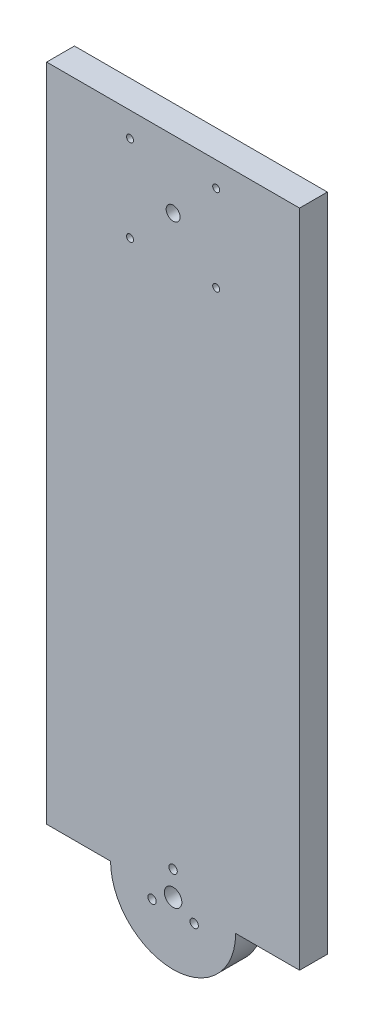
from build123d import *

# Parameters (mm, degrees)
SKETCH1_R           = 1.25
SKETCH1_R_2         = 2.5
SKETCH1_R_3         = 1.5
SKETCH1_R_4         = 3.15
BOSS_EXTRUDE1_DEPTH = 10
SKETCH2_W           = 10
SKETCH2_H           = 237.5
BOSS_EXTRUDE2_DEPTH = 23
SKETCH3_W           = 10
SKETCH3_H           = 237.5
BOSS_EXTRUDE3_DEPTH = 23


with BuildPart() as part:
    # Sketch1 → Boss-Extrude1 (new body)
    with BuildSketch(Plane.XY):
        with BuildLine():
            Line((-22.5, 130), (22.5, 130))
            Line((22.5, 130), (22.5, -107.5))
            ThreePointArc((22.5, -107.5), (0, -130), (-22.5, -107.5))
            Line((-22.5, -107.5), (-22.5, 130))
        make_face()
        with Locations((-15.5, 121.163920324)):
            Circle(SKETCH1_R, mode=Mode.SUBTRACT)
        with Locations(Location((15.5, 121.163920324, 0), (0, 0, 180))):
            Circle(SKETCH1_R, mode=Mode.SUBTRACT)
        with Locations((15.5, 90.163920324)):
            Circle(SKETCH1_R, mode=Mode.SUBTRACT)
        with Locations(Location((-15.5, 90.163920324, 0), (0, 0, 180))):
            Circle(SKETCH1_R, mode=Mode.SUBTRACT)
        with Locations((0, 105.663920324)):
            Circle(SKETCH1_R_2, mode=Mode.SUBTRACT)
        with Locations((0, -98.75)):
            Circle(SKETCH1_R_3, mode=Mode.SUBTRACT)
        with Locations((7.577722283, -111.875)):
            Circle(SKETCH1_R_3, mode=Mode.SUBTRACT)
        with Locations((-7.577722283, -111.875)):
            Circle(SKETCH1_R_3, mode=Mode.SUBTRACT)
        with Locations((0, -107.5)):
            Circle(SKETCH1_R_4, mode=Mode.SUBTRACT)
    extrude(amount=BOSS_EXTRUDE1_DEPTH)

    # Sketch2 → Boss-Extrude2 (add)
    with BuildSketch(Plane(origin=(22.5, 0, 0), x_dir=(0, 0, -1), z_dir=(1, 0, 0))):
        with Locations((-5, 11.25)):
            Rectangle(SKETCH2_W, SKETCH2_H)
    extrude(amount=BOSS_EXTRUDE2_DEPTH)

    # Sketch3 → Boss-Extrude3 (add)
    with BuildSketch(Plane.ZY.offset(22.5)):
        with Locations((5, 11.25)):
            Rectangle(SKETCH3_W, SKETCH3_H)
    extrude(amount=BOSS_EXTRUDE3_DEPTH)


solid = part.part
